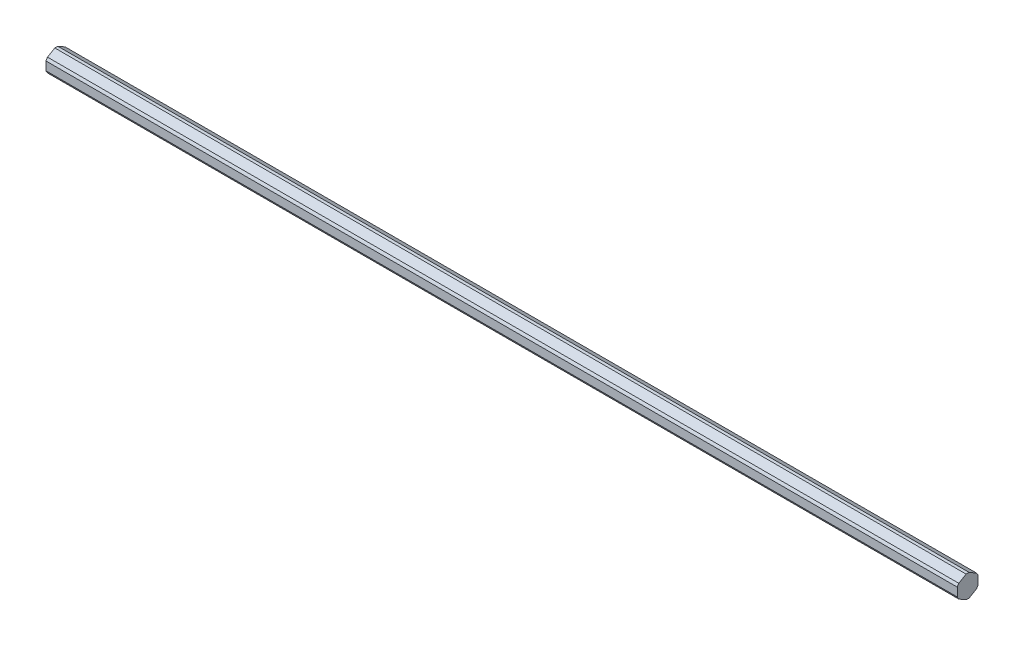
ISO-10303-21;
HEADER;
FILE_DESCRIPTION(('STEP AP214'),'2;1');
FILE_NAME('part.step','',(''),(''),'','','');
FILE_SCHEMA(('AUTOMOTIVE_DESIGN { 1 0 10303 214 1 1 1 1 }'));
ENDSEC;
DATA;
#1=APPLICATION_CONTEXT('core data for automotive mechanical design processes');
#2=APPLICATION_PROTOCOL_DEFINITION('international standard','automotive_design',2000,#1);
#3=PRODUCT_CONTEXT('',#1,'mechanical');
#4=PRODUCT('Part','Part','',(#3));
#5=PRODUCT_RELATED_PRODUCT_CATEGORY('part','',(#4));
#6=PRODUCT_DEFINITION_FORMATION('','',#4);
#7=PRODUCT_DEFINITION_CONTEXT('part definition',#1,'design');
#8=PRODUCT_DEFINITION('design','',#6,#7);
#9=PRODUCT_DEFINITION_SHAPE('','',#8);
#10=(LENGTH_UNIT() NAMED_UNIT(*) SI_UNIT(.MILLI.,.METRE.));
#11=(NAMED_UNIT(*) PLANE_ANGLE_UNIT() SI_UNIT($,.RADIAN.));
#12=(NAMED_UNIT(*) SI_UNIT($,.STERADIAN.) SOLID_ANGLE_UNIT());
#13=UNCERTAINTY_MEASURE_WITH_UNIT(LENGTH_MEASURE(1.E-05),#10,'distance_accuracy_value','');
#14=(GEOMETRIC_REPRESENTATION_CONTEXT(3) GLOBAL_UNCERTAINTY_ASSIGNED_CONTEXT((#13)) GLOBAL_UNIT_ASSIGNED_CONTEXT((#10,
#11,#12)) REPRESENTATION_CONTEXT('',''));
#15=CARTESIAN_POINT('',(0.,0.,0.));
#16=DIRECTION('',(0.,0.,1.));
#17=DIRECTION('',(1.,0.,0.));
#18=AXIS2_PLACEMENT_3D('',#15,#16,#17);
#19=CARTESIAN_POINT('',(-765.930228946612,-134.308961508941,428.125730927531));
#20=DIRECTION('',(1.,0.,0.));
#21=DIRECTION('',(0.,1.,0.));
#22=AXIS2_PLACEMENT_3D('',#19,#20,#21);
#23=CYLINDRICAL_SURFACE('',#22,6.86485799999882);
#24=CARTESIAN_POINT('',(-273.05,-134.308961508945,428.125730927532));
#25=DIRECTION('',(1.,0.,0.));
#26=DIRECTION('',(0.,1.,0.));
#27=AXIS2_PLACEMENT_3D('',#24,#25,#26);
#28=CIRCLE('',#27,6.86485799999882);
#29=CARTESIAN_POINT('',(-273.05,-141.112232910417,429.043213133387));
#30=VERTEX_POINT('',#29);
#31=CARTESIAN_POINT('',(-273.05,-141.112232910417,427.208248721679));
#32=VERTEX_POINT('',#31);
#33=EDGE_CURVE('E209',#30,#32,#28,.T.);
#34=ORIENTED_EDGE('',*,*,#33,.T.);
#35=DIRECTION('',(1.,0.,0.));
#36=VECTOR('',#35,1.);
#37=CARTESIAN_POINT('',(-765.930228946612,-141.112232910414,427.208248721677));
#38=LINE('',#37,#36);
#39=CARTESIAN_POINT('',(285.75,-141.112232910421,427.20824872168));
#40=VERTEX_POINT('',#39);
#41=EDGE_CURVE('E157',#32,#40,#38,.T.);
#42=ORIENTED_EDGE('',*,*,#41,.T.);
#43=CARTESIAN_POINT('',(285.75,-134.308961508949,428.125730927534));
#44=DIRECTION('',(1.,0.,0.));
#45=DIRECTION('',(0.,1.,0.));
#46=AXIS2_PLACEMENT_3D('',#43,#44,#45);
#47=CIRCLE('',#46,6.86485799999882);
#48=CARTESIAN_POINT('',(285.75,-141.112232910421,429.043213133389));
#49=VERTEX_POINT('',#48);
#50=EDGE_CURVE('E139',#49,#40,#47,.T.);
#51=ORIENTED_EDGE('',*,*,#50,.F.);
#52=DIRECTION('',(1.,0.,0.));
#53=VECTOR('',#52,1.);
#54=CARTESIAN_POINT('',(-765.930228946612,-141.112232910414,429.043213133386));
#55=LINE('',#54,#53);
#56=EDGE_CURVE('E143',#30,#49,#55,.T.);
#57=ORIENTED_EDGE('',*,*,#56,.F.);
#58=EDGE_LOOP('',(#34,#42,#51,#57));
#59=FACE_BOUND('',#58,.T.);
#60=ADVANCED_FACE('F17',(#59),#23,.T.);
#61=CARTESIAN_POINT('',(-765.930228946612,-134.308961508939,428.125730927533));
#62=DIRECTION('',(1.,0.,0.));
#63=DIRECTION('',(0.,1.,0.));
#64=AXIS2_PLACEMENT_3D('',#61,#62,#63);
#65=CYLINDRICAL_SURFACE('',#64,6.86485800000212);
#66=CARTESIAN_POINT('',(-273.05,-134.308961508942,428.125730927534));
#67=DIRECTION('',(1.,0.,0.));
#68=DIRECTION('',(0.,1.,0.));
#69=AXIS2_PLACEMENT_3D('',#66,#67,#68);
#70=CIRCLE('',#69,6.86485800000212);
#71=CARTESIAN_POINT('',(-273.05,-138.50516010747,422.692666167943));
#72=VERTEX_POINT('',#71);
#73=CARTESIAN_POINT('',(-273.05,-136.916034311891,421.77518396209));
#74=VERTEX_POINT('',#73);
#75=EDGE_CURVE('E107',#72,#74,#70,.T.);
#76=ORIENTED_EDGE('',*,*,#75,.T.);
#77=DIRECTION('',(1.,0.,0.));
#78=VECTOR('',#77,1.);
#79=CARTESIAN_POINT('',(-765.930228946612,-136.916034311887,421.775183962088));
#80=LINE('',#79,#78);
#81=CARTESIAN_POINT('',(285.75,-136.916034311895,421.775183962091));
#82=VERTEX_POINT('',#81);
#83=EDGE_CURVE('E137',#74,#82,#80,.T.);
#84=ORIENTED_EDGE('',*,*,#83,.T.);
#85=CARTESIAN_POINT('',(285.75,-134.308961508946,428.125730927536));
#86=DIRECTION('',(1.,0.,0.));
#87=DIRECTION('',(0.,1.,0.));
#88=AXIS2_PLACEMENT_3D('',#85,#86,#87);
#89=CIRCLE('',#88,6.86485800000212);
#90=CARTESIAN_POINT('',(285.75,-138.505160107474,422.692666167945));
#91=VERTEX_POINT('',#90);
#92=EDGE_CURVE('E142',#91,#82,#89,.T.);
#93=ORIENTED_EDGE('',*,*,#92,.F.);
#94=DIRECTION('',(1.,0.,0.));
#95=VECTOR('',#94,1.);
#96=CARTESIAN_POINT('',(-765.930228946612,-138.505160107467,422.692666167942));
#97=LINE('',#96,#95);
#98=EDGE_CURVE('E138',#72,#91,#97,.T.);
#99=ORIENTED_EDGE('',*,*,#98,.F.);
#100=EDGE_LOOP('',(#76,#84,#93,#99));
#101=FACE_BOUND('',#100,.T.);
#102=ADVANCED_FACE('F310',(#101),#65,.T.);
#103=CARTESIAN_POINT('',(-765.930228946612,-134.308961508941,428.125730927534));
#104=DIRECTION('',(1.,0.,0.));
#105=DIRECTION('',(0.,1.,0.));
#106=AXIS2_PLACEMENT_3D('',#103,#104,#105);
#107=CYLINDRICAL_SURFACE('',#106,6.86485800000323);
#108=CARTESIAN_POINT('',(-273.05,-134.308961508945,428.125730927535));
#109=DIRECTION('',(1.,0.,0.));
#110=DIRECTION('',(0.,1.,0.));
#111=AXIS2_PLACEMENT_3D('',#108,#109,#110);
#112=CIRCLE('',#111,6.86485800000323);
#113=CARTESIAN_POINT('',(-273.05,-131.701888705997,421.77518396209));
#114=VERTEX_POINT('',#113);
#115=CARTESIAN_POINT('',(-273.05,-130.112762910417,422.692666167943));
#116=VERTEX_POINT('',#115);
#117=EDGE_CURVE('E98',#114,#116,#112,.T.);
#118=ORIENTED_EDGE('',*,*,#117,.T.);
#119=DIRECTION('',(1.,0.,0.));
#120=VECTOR('',#119,1.);
#121=CARTESIAN_POINT('',(-765.930228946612,-130.112762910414,422.692666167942));
#122=LINE('',#121,#120);
#123=CARTESIAN_POINT('',(285.75,-130.112762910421,422.692666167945));
#124=VERTEX_POINT('',#123);
#125=EDGE_CURVE('E101',#116,#124,#122,.T.);
#126=ORIENTED_EDGE('',*,*,#125,.T.);
#127=CARTESIAN_POINT('',(285.75,-134.308961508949,428.125730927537));
#128=DIRECTION('',(1.,0.,0.));
#129=DIRECTION('',(0.,1.,0.));
#130=AXIS2_PLACEMENT_3D('',#127,#128,#129);
#131=CIRCLE('',#130,6.86485800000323);
#132=CARTESIAN_POINT('',(285.75,-131.701888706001,421.775183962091));
#133=VERTEX_POINT('',#132);
#134=EDGE_CURVE('E227',#133,#124,#131,.T.);
#135=ORIENTED_EDGE('',*,*,#134,.F.);
#136=DIRECTION('',(1.,0.,0.));
#137=VECTOR('',#136,1.);
#138=CARTESIAN_POINT('',(-765.930228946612,-131.701888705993,421.775183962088));
#139=LINE('',#138,#137);
#140=EDGE_CURVE('E103',#114,#133,#139,.T.);
#141=ORIENTED_EDGE('',*,*,#140,.F.);
#142=EDGE_LOOP('',(#118,#126,#135,#141));
#143=FACE_BOUND('',#142,.T.);
#144=ADVANCED_FACE('F99',(#143),#107,.T.);
#145=CARTESIAN_POINT('',(-765.930228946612,-134.308961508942,428.125730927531));
#146=DIRECTION('',(1.,0.,0.));
#147=DIRECTION('',(0.,1.,0.));
#148=AXIS2_PLACEMENT_3D('',#145,#146,#147);
#149=CYLINDRICAL_SURFACE('',#148,6.8648580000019);
#150=CARTESIAN_POINT('',(-273.05,-134.308961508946,428.125730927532));
#151=DIRECTION('',(1.,0.,0.));
#152=DIRECTION('',(0.,1.,0.));
#153=AXIS2_PLACEMENT_3D('',#150,#151,#152);
#154=CIRCLE('',#153,6.8648580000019);
#155=CARTESIAN_POINT('',(-273.05,-127.50569010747,427.208248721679));
#156=VERTEX_POINT('',#155);
#157=CARTESIAN_POINT('',(-273.05,-127.50569010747,429.043213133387));
#158=VERTEX_POINT('',#157);
#159=EDGE_CURVE('E51',#156,#158,#154,.T.);
#160=ORIENTED_EDGE('',*,*,#159,.T.);
#161=DIRECTION('',(1.,0.,0.));
#162=VECTOR('',#161,1.);
#163=CARTESIAN_POINT('',(-765.930228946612,-127.505690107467,429.043213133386));
#164=LINE('',#163,#162);
#165=CARTESIAN_POINT('',(285.75,-127.505690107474,429.043213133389));
#166=VERTEX_POINT('',#165);
#167=EDGE_CURVE('E130',#158,#166,#164,.T.);
#168=ORIENTED_EDGE('',*,*,#167,.T.);
#169=CARTESIAN_POINT('',(285.75,-134.30896150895,428.125730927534));
#170=DIRECTION('',(1.,0.,0.));
#171=DIRECTION('',(0.,1.,0.));
#172=AXIS2_PLACEMENT_3D('',#169,#170,#171);
#173=CIRCLE('',#172,6.8648580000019);
#174=CARTESIAN_POINT('',(285.75,-127.505690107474,427.20824872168));
#175=VERTEX_POINT('',#174);
#176=EDGE_CURVE('E38',#175,#166,#173,.T.);
#177=ORIENTED_EDGE('',*,*,#176,.F.);
#178=DIRECTION('',(1.,0.,0.));
#179=VECTOR('',#178,1.);
#180=CARTESIAN_POINT('',(-765.930228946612,-127.505690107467,427.208248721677));
#181=LINE('',#180,#179);
#182=EDGE_CURVE('E116',#156,#175,#181,.T.);
#183=ORIENTED_EDGE('',*,*,#182,.F.);
#184=EDGE_LOOP('',(#160,#168,#177,#183));
#185=FACE_BOUND('',#184,.T.);
#186=ADVANCED_FACE('F335',(#185),#149,.T.);
#187=CARTESIAN_POINT('',(-765.930228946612,-134.308961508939,428.125730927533));
#188=DIRECTION('',(1.,0.,0.));
#189=DIRECTION('',(0.,1.,0.));
#190=AXIS2_PLACEMENT_3D('',#187,#188,#189);
#191=CYLINDRICAL_SURFACE('',#190,6.8648579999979);
#192=CARTESIAN_POINT('',(-273.05,-134.308961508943,428.125730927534));
#193=DIRECTION('',(1.,0.,0.));
#194=DIRECTION('',(0.,1.,0.));
#195=AXIS2_PLACEMENT_3D('',#192,#193,#194);
#196=CIRCLE('',#195,6.8648579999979);
#197=CARTESIAN_POINT('',(-273.05,-130.112762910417,433.558795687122));
#198=VERTEX_POINT('',#197);
#199=CARTESIAN_POINT('',(-273.05,-131.701888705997,434.476277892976));
#200=VERTEX_POINT('',#199);
#201=EDGE_CURVE('E217',#198,#200,#196,.T.);
#202=ORIENTED_EDGE('',*,*,#201,.T.);
#203=DIRECTION('',(1.,0.,0.));
#204=VECTOR('',#203,1.);
#205=CARTESIAN_POINT('',(-765.930228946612,-131.701888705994,434.476277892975));
#206=LINE('',#205,#204);
#207=CARTESIAN_POINT('',(285.75,-131.701888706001,434.476277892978));
#208=VERTEX_POINT('',#207);
#209=EDGE_CURVE('E165',#200,#208,#206,.T.);
#210=ORIENTED_EDGE('',*,*,#209,.T.);
#211=CARTESIAN_POINT('',(285.75,-134.308961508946,428.125730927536));
#212=DIRECTION('',(1.,0.,0.));
#213=DIRECTION('',(0.,1.,0.));
#214=AXIS2_PLACEMENT_3D('',#211,#212,#213);
#215=CIRCLE('',#214,6.8648579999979);
#216=CARTESIAN_POINT('',(285.75,-130.112762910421,433.558795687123));
#217=VERTEX_POINT('',#216);
#218=EDGE_CURVE('E20',#217,#208,#215,.T.);
#219=ORIENTED_EDGE('',*,*,#218,.F.);
#220=DIRECTION('',(1.,0.,0.));
#221=VECTOR('',#220,1.);
#222=CARTESIAN_POINT('',(-765.930228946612,-130.112762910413,433.55879568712));
#223=LINE('',#222,#221);
#224=EDGE_CURVE('E152',#198,#217,#223,.T.);
#225=ORIENTED_EDGE('',*,*,#224,.F.);
#226=EDGE_LOOP('',(#202,#210,#219,#225));
#227=FACE_BOUND('',#226,.T.);
#228=ADVANCED_FACE('F253',(#227),#191,.T.);
#229=CARTESIAN_POINT('',(-765.930228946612,-134.30896150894,428.12573092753));
#230=DIRECTION('',(1.,0.,0.));
#231=DIRECTION('',(0.,1.,0.));
#232=AXIS2_PLACEMENT_3D('',#229,#230,#231);
#233=CYLINDRICAL_SURFACE('',#232,6.86485800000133);
#234=CARTESIAN_POINT('',(-273.05,-134.308961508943,428.125730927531));
#235=DIRECTION('',(1.,0.,0.));
#236=DIRECTION('',(0.,1.,0.));
#237=AXIS2_PLACEMENT_3D('',#234,#235,#236);
#238=CIRCLE('',#237,6.86485800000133);
#239=CARTESIAN_POINT('',(-273.05,-136.91603431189,434.476277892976));
#240=VERTEX_POINT('',#239);
#241=CARTESIAN_POINT('',(-273.05,-138.50516010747,433.558795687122));
#242=VERTEX_POINT('',#241);
#243=EDGE_CURVE('E213',#240,#242,#238,.T.);
#244=ORIENTED_EDGE('',*,*,#243,.T.);
#245=DIRECTION('',(1.,0.,0.));
#246=VECTOR('',#245,1.);
#247=CARTESIAN_POINT('',(-765.930228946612,-138.505160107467,433.55879568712));
#248=LINE('',#247,#246);
#249=CARTESIAN_POINT('',(285.75,-138.505160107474,433.558795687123));
#250=VERTEX_POINT('',#249);
#251=EDGE_CURVE('E153',#242,#250,#248,.T.);
#252=ORIENTED_EDGE('',*,*,#251,.T.);
#253=CARTESIAN_POINT('',(285.75,-134.308961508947,428.125730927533));
#254=DIRECTION('',(1.,0.,0.));
#255=DIRECTION('',(0.,1.,0.));
#256=AXIS2_PLACEMENT_3D('',#253,#254,#255);
#257=CIRCLE('',#256,6.86485800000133);
#258=CARTESIAN_POINT('',(285.75,-136.916034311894,434.476277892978));
#259=VERTEX_POINT('',#258);
#260=EDGE_CURVE('E11',#259,#250,#257,.T.);
#261=ORIENTED_EDGE('',*,*,#260,.F.);
#262=DIRECTION('',(1.,0.,0.));
#263=VECTOR('',#262,1.);
#264=CARTESIAN_POINT('',(-765.930228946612,-136.916034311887,434.476277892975));
#265=LINE('',#264,#263);
#266=EDGE_CURVE('E176',#240,#259,#265,.T.);
#267=ORIENTED_EDGE('',*,*,#266,.F.);
#268=EDGE_LOOP('',(#244,#252,#261,#267));
#269=FACE_BOUND('',#268,.T.);
#270=ADVANCED_FACE('F298',(#269),#233,.T.);
#271=CARTESIAN_POINT('',(285.75,-134.308961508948,428.125730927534));
#272=DIRECTION('',(-1.,0.,0.));
#273=DIRECTION('',(0.,0.,1.));
#274=AXIS2_PLACEMENT_3D('',#271,#272,#273);
#275=PLANE('',#274);
#276=DIRECTION('',(0.,0.5,0.866025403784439));
#277=VECTOR('',#276,1.);
#278=CARTESIAN_POINT('',(285.75,-139.808696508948,431.301004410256));
#279=LINE('',#278,#277);
#280=EDGE_CURVE('E146',#49,#250,#279,.T.);
#281=ORIENTED_EDGE('',*,*,#280,.F.);
#282=ORIENTED_EDGE('',*,*,#50,.T.);
#283=DIRECTION('',(0.,-0.5,0.866025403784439));
#284=VECTOR('',#283,1.);
#285=CARTESIAN_POINT('',(285.75,-139.808696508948,424.950457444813));
#286=LINE('',#285,#284);
#287=EDGE_CURVE('E133',#91,#40,#286,.T.);
#288=ORIENTED_EDGE('',*,*,#287,.F.);
#289=ORIENTED_EDGE('',*,*,#92,.T.);
#290=DIRECTION('',(0.,-1.,0.));
#291=VECTOR('',#290,1.);
#292=CARTESIAN_POINT('',(285.75,-134.308961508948,421.775183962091));
#293=LINE('',#292,#291);
#294=EDGE_CURVE('E122',#133,#82,#293,.T.);
#295=ORIENTED_EDGE('',*,*,#294,.F.);
#296=ORIENTED_EDGE('',*,*,#134,.T.);
#297=DIRECTION('',(0.,-0.5,-0.866025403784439));
#298=VECTOR('',#297,1.);
#299=CARTESIAN_POINT('',(285.75,-128.809226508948,424.950457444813));
#300=LINE('',#299,#298);
#301=EDGE_CURVE('E120',#175,#124,#300,.T.);
#302=ORIENTED_EDGE('',*,*,#301,.F.);
#303=ORIENTED_EDGE('',*,*,#176,.T.);
#304=DIRECTION('',(0.,0.5,-0.866025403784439));
#305=VECTOR('',#304,1.);
#306=CARTESIAN_POINT('',(285.75,-128.809226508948,431.301004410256));
#307=LINE('',#306,#305);
#308=EDGE_CURVE('E161',#217,#166,#307,.T.);
#309=ORIENTED_EDGE('',*,*,#308,.F.);
#310=ORIENTED_EDGE('',*,*,#218,.T.);
#311=DIRECTION('',(0.,1.,0.));
#312=VECTOR('',#311,1.);
#313=CARTESIAN_POINT('',(285.75,-134.308961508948,434.476277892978));
#314=LINE('',#313,#312);
#315=EDGE_CURVE('E180',#259,#208,#314,.T.);
#316=ORIENTED_EDGE('',*,*,#315,.F.);
#317=ORIENTED_EDGE('',*,*,#260,.T.);
#318=EDGE_LOOP('',(#281,#282,#288,#289,#295,#296,#302,#303,#309,#310,#316,#317));
#319=FACE_BOUND('',#318,.T.);
#320=ADVANCED_FACE('F242',(#319),#275,.F.);
#321=CARTESIAN_POINT('',(-273.05,-134.308961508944,428.125730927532));
#322=DIRECTION('',(1.,0.,0.));
#323=DIRECTION('',(0.,-1.,0.));
#324=AXIS2_PLACEMENT_3D('',#321,#322,#323);
#325=PLANE('',#324);
#326=ORIENTED_EDGE('',*,*,#33,.F.);
#327=DIRECTION('',(0.,-0.5,-0.866025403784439));
#328=VECTOR('',#327,1.);
#329=CARTESIAN_POINT('',(-273.05,-139.808696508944,431.301004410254));
#330=LINE('',#329,#328);
#331=EDGE_CURVE('E147',#242,#30,#330,.T.);
#332=ORIENTED_EDGE('',*,*,#331,.F.);
#333=ORIENTED_EDGE('',*,*,#243,.F.);
#334=DIRECTION('',(0.,-1.,0.));
#335=VECTOR('',#334,1.);
#336=CARTESIAN_POINT('',(-273.05,-134.308961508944,434.476277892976));
#337=LINE('',#336,#335);
#338=EDGE_CURVE('E169',#200,#240,#337,.T.);
#339=ORIENTED_EDGE('',*,*,#338,.F.);
#340=ORIENTED_EDGE('',*,*,#201,.F.);
#341=DIRECTION('',(0.,-0.5,0.866025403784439));
#342=VECTOR('',#341,1.);
#343=CARTESIAN_POINT('',(-273.05,-128.809226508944,431.301004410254));
#344=LINE('',#343,#342);
#345=EDGE_CURVE('E132',#158,#198,#344,.T.);
#346=ORIENTED_EDGE('',*,*,#345,.F.);
#347=ORIENTED_EDGE('',*,*,#159,.F.);
#348=DIRECTION('',(0.,0.5,0.866025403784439));
#349=VECTOR('',#348,1.);
#350=CARTESIAN_POINT('',(-273.05,-128.809226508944,424.950457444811));
#351=LINE('',#350,#349);
#352=EDGE_CURVE('E110',#116,#156,#351,.T.);
#353=ORIENTED_EDGE('',*,*,#352,.F.);
#354=ORIENTED_EDGE('',*,*,#117,.F.);
#355=DIRECTION('',(0.,1.,0.));
#356=VECTOR('',#355,1.);
#357=CARTESIAN_POINT('',(-273.05,-134.308961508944,421.77518396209));
#358=LINE('',#357,#356);
#359=EDGE_CURVE('E191',#74,#114,#358,.T.);
#360=ORIENTED_EDGE('',*,*,#359,.F.);
#361=ORIENTED_EDGE('',*,*,#75,.F.);
#362=DIRECTION('',(0.,0.5,-0.866025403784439));
#363=VECTOR('',#362,1.);
#364=CARTESIAN_POINT('',(-273.05,-139.808696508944,424.950457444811));
#365=LINE('',#364,#363);
#366=EDGE_CURVE('E184',#32,#72,#365,.T.);
#367=ORIENTED_EDGE('',*,*,#366,.F.);
#368=EDGE_LOOP('',(#326,#332,#333,#339,#340,#346,#347,#353,#354,#360,#361,#367));
#369=FACE_BOUND('',#368,.T.);
#370=ADVANCED_FACE('F112',(#369),#325,.F.);
#371=CARTESIAN_POINT('',(-273.05,-128.809226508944,424.950457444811));
#372=DIRECTION('',(0.,0.866025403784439,-0.5));
#373=DIRECTION('',(-1.,0.,0.));
#374=AXIS2_PLACEMENT_3D('',#371,#372,#373);
#375=PLANE('',#374);
#376=ORIENTED_EDGE('',*,*,#125,.F.);
#377=ORIENTED_EDGE('',*,*,#352,.T.);
#378=ORIENTED_EDGE('',*,*,#182,.T.);
#379=ORIENTED_EDGE('',*,*,#301,.T.);
#380=EDGE_LOOP('',(#376,#377,#378,#379));
#381=FACE_BOUND('',#380,.T.);
#382=ADVANCED_FACE('F119',(#381),#375,.T.);
#383=CARTESIAN_POINT('',(-273.05,-134.308961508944,421.77518396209));
#384=DIRECTION('',(0.,0.,-1.));
#385=DIRECTION('',(0.,-1.,0.));
#386=AXIS2_PLACEMENT_3D('',#383,#384,#385);
#387=PLANE('',#386);
#388=ORIENTED_EDGE('',*,*,#83,.F.);
#389=ORIENTED_EDGE('',*,*,#359,.T.);
#390=ORIENTED_EDGE('',*,*,#140,.T.);
#391=ORIENTED_EDGE('',*,*,#294,.T.);
#392=EDGE_LOOP('',(#388,#389,#390,#391));
#393=FACE_BOUND('',#392,.T.);
#394=ADVANCED_FACE('F314',(#393),#387,.T.);
#395=CARTESIAN_POINT('',(-273.05,-139.808696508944,424.950457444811));
#396=DIRECTION('',(0.,-0.866025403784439,-0.5));
#397=DIRECTION('',(0.,0.5,-0.866025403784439));
#398=AXIS2_PLACEMENT_3D('',#395,#396,#397);
#399=PLANE('',#398);
#400=ORIENTED_EDGE('',*,*,#41,.F.);
#401=ORIENTED_EDGE('',*,*,#366,.T.);
#402=ORIENTED_EDGE('',*,*,#98,.T.);
#403=ORIENTED_EDGE('',*,*,#287,.T.);
#404=EDGE_LOOP('',(#400,#401,#402,#403));
#405=FACE_BOUND('',#404,.T.);
#406=ADVANCED_FACE('F307',(#405),#399,.T.);
#407=CARTESIAN_POINT('',(-273.05,-139.808696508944,431.301004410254));
#408=DIRECTION('',(0.,-0.866025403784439,0.5));
#409=DIRECTION('',(-1.,0.,0.));
#410=AXIS2_PLACEMENT_3D('',#407,#408,#409);
#411=PLANE('',#410);
#412=ORIENTED_EDGE('',*,*,#331,.T.);
#413=ORIENTED_EDGE('',*,*,#56,.T.);
#414=ORIENTED_EDGE('',*,*,#280,.T.);
#415=ORIENTED_EDGE('',*,*,#251,.F.);
#416=EDGE_LOOP('',(#412,#413,#414,#415));
#417=FACE_BOUND('',#416,.T.);
#418=ADVANCED_FACE('F300',(#417),#411,.T.);
#419=CARTESIAN_POINT('',(-273.05,-134.308961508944,434.476277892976));
#420=DIRECTION('',(0.,0.,1.));
#421=DIRECTION('',(1.,0.,0.));
#422=AXIS2_PLACEMENT_3D('',#419,#420,#421);
#423=PLANE('',#422);
#424=ORIENTED_EDGE('',*,*,#209,.F.);
#425=ORIENTED_EDGE('',*,*,#338,.T.);
#426=ORIENTED_EDGE('',*,*,#266,.T.);
#427=ORIENTED_EDGE('',*,*,#315,.T.);
#428=EDGE_LOOP('',(#424,#425,#426,#427));
#429=FACE_BOUND('',#428,.T.);
#430=ADVANCED_FACE('F251',(#429),#423,.T.);
#431=CARTESIAN_POINT('',(-273.05,-128.809226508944,431.301004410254));
#432=DIRECTION('',(0.,0.866025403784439,0.5));
#433=DIRECTION('',(1.,0.,0.));
#434=AXIS2_PLACEMENT_3D('',#431,#432,#433);
#435=PLANE('',#434);
#436=ORIENTED_EDGE('',*,*,#167,.F.);
#437=ORIENTED_EDGE('',*,*,#345,.T.);
#438=ORIENTED_EDGE('',*,*,#224,.T.);
#439=ORIENTED_EDGE('',*,*,#308,.T.);
#440=EDGE_LOOP('',(#436,#437,#438,#439));
#441=FACE_BOUND('',#440,.T.);
#442=ADVANCED_FACE('F419',(#441),#435,.T.);
#443=CLOSED_SHELL('',(#60,#102,#144,#186,#228,#270,#320,#370,#382,#394,#406,#418,#430,#442));
#444=MANIFOLD_SOLID_BREP('B1',#443);
#445=ADVANCED_BREP_SHAPE_REPRESENTATION('',(#18,#444),#14);
#446=SHAPE_DEFINITION_REPRESENTATION(#9,#445);
ENDSEC;
END-ISO-10303-21;
